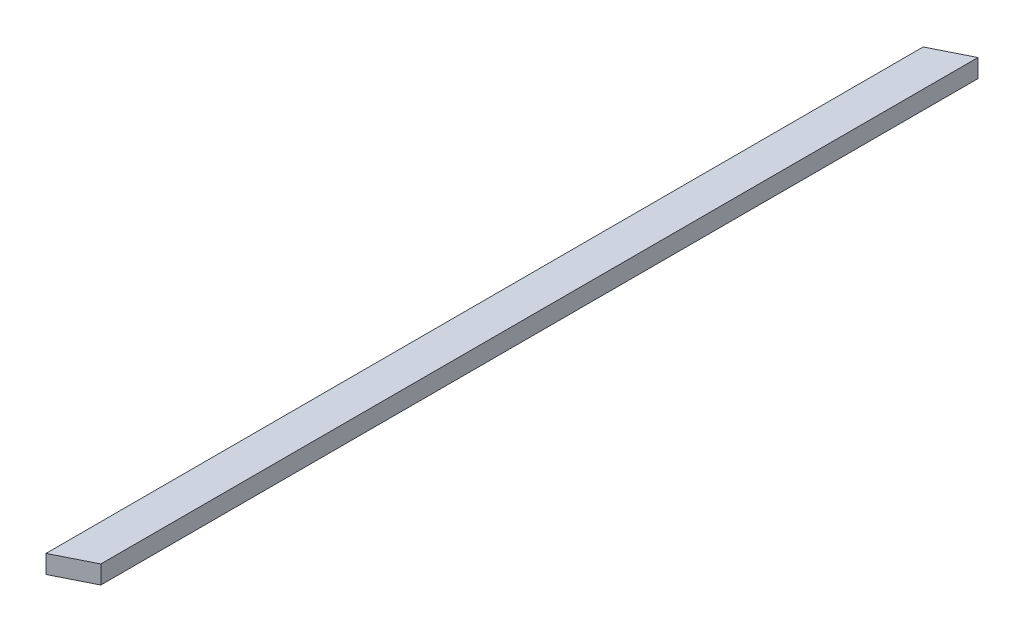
from build123d import *

# Parameters (mm, degrees)
BOSS_EXTRUDE1_DEPTH = 50.8


with BuildPart() as part:
    # Sketch1 → Boss-Extrude1 (new body)
    with BuildSketch(Plane(origin=(0, 0, 0), x_dir=(1, 0, 0), z_dir=(0, 1, 0))):
        Polygon((0, 0), (0, -2438.4), (-101.6, -2489.210969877), (-101.6, -50.810969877), align=None)
    extrude(amount=BOSS_EXTRUDE1_DEPTH)


solid = part.part
